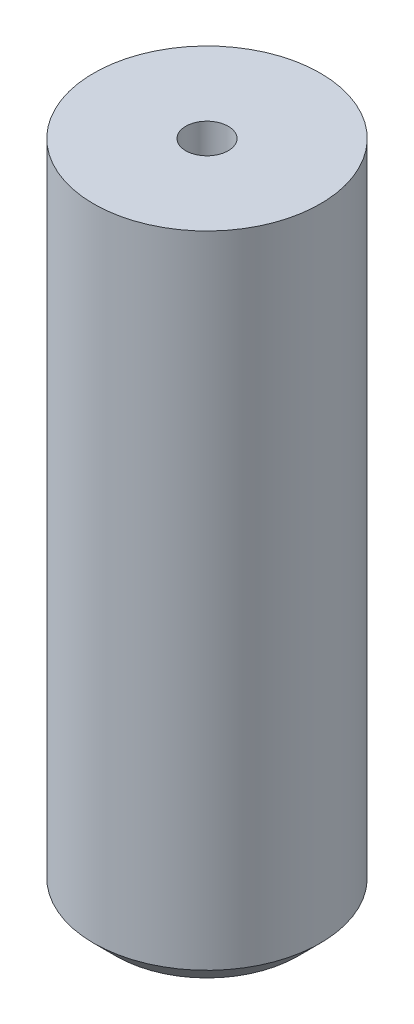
ISO-10303-21;
HEADER;
FILE_DESCRIPTION(('STEP AP214'),'2;1');
FILE_NAME('part.step','',(''),(''),'','','');
FILE_SCHEMA(('AUTOMOTIVE_DESIGN { 1 0 10303 214 1 1 1 1 }'));
ENDSEC;
DATA;
#1=APPLICATION_CONTEXT('core data for automotive mechanical design processes');
#2=APPLICATION_PROTOCOL_DEFINITION('international standard','automotive_design',2000,#1);
#3=PRODUCT_CONTEXT('',#1,'mechanical');
#4=PRODUCT('Part','Part','',(#3));
#5=PRODUCT_RELATED_PRODUCT_CATEGORY('part','',(#4));
#6=PRODUCT_DEFINITION_FORMATION('','',#4);
#7=PRODUCT_DEFINITION_CONTEXT('part definition',#1,'design');
#8=PRODUCT_DEFINITION('design','',#6,#7);
#9=PRODUCT_DEFINITION_SHAPE('','',#8);
#10=(LENGTH_UNIT() NAMED_UNIT(*) SI_UNIT(.MILLI.,.METRE.));
#11=(NAMED_UNIT(*) PLANE_ANGLE_UNIT() SI_UNIT($,.RADIAN.));
#12=(NAMED_UNIT(*) SI_UNIT($,.STERADIAN.) SOLID_ANGLE_UNIT());
#13=UNCERTAINTY_MEASURE_WITH_UNIT(LENGTH_MEASURE(1.E-05),#10,'distance_accuracy_value','');
#14=(GEOMETRIC_REPRESENTATION_CONTEXT(3) GLOBAL_UNCERTAINTY_ASSIGNED_CONTEXT((#13)) GLOBAL_UNIT_ASSIGNED_CONTEXT((#10,
#11,#12)) REPRESENTATION_CONTEXT('',''));
#15=CARTESIAN_POINT('',(0.,0.,0.));
#16=DIRECTION('',(0.,0.,1.));
#17=DIRECTION('',(1.,0.,0.));
#18=AXIS2_PLACEMENT_3D('',#15,#16,#17);
#19=CARTESIAN_POINT('',(0.,0.,0.));
#20=DIRECTION('',(0.,1.,0.));
#21=DIRECTION('',(0.,0.,1.));
#22=AXIS2_PLACEMENT_3D('',#19,#20,#21);
#23=PLANE('',#22);
#24=CARTESIAN_POINT('',(0.,0.,0.));
#25=DIRECTION('',(0.,1.,0.));
#26=DIRECTION('',(0.,0.,1.));
#27=AXIS2_PLACEMENT_3D('',#24,#25,#26);
#28=CIRCLE('',#27,0.374999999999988);
#29=CARTESIAN_POINT('',(0.,0.,0.374999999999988));
#30=VERTEX_POINT('',#29);
#31=EDGE_CURVE('E55',#30,#30,#28,.T.);
#32=ORIENTED_EDGE('',*,*,#31,.F.);
#33=EDGE_LOOP('',(#32));
#34=FACE_BOUND('',#33,.T.);
#35=CARTESIAN_POINT('',(0.,0.,0.));
#36=DIRECTION('',(0.,-1.,0.));
#37=DIRECTION('',(0.,0.,-1.));
#38=AXIS2_PLACEMENT_3D('',#35,#36,#37);
#39=CIRCLE('',#38,2.);
#40=CARTESIAN_POINT('',(0.,0.,-2.));
#41=VERTEX_POINT('',#40);
#42=EDGE_CURVE('E10',#41,#41,#39,.T.);
#43=ORIENTED_EDGE('',*,*,#42,.F.);
#44=EDGE_LOOP('',(#43));
#45=FACE_BOUND('',#44,.T.);
#46=ADVANCED_FACE('F30',(#34,#45),#23,.T.);
#47=CARTESIAN_POINT('',(0.,0.,0.));
#48=DIRECTION('',(0.,-1.,0.));
#49=DIRECTION('',(0.,0.,-1.));
#50=AXIS2_PLACEMENT_3D('',#47,#48,#49);
#51=CYLINDRICAL_SURFACE('',#50,2.);
#52=ORIENTED_EDGE('',*,*,#42,.T.);
#53=EDGE_LOOP('',(#52));
#54=FACE_BOUND('',#53,.T.);
#55=CARTESIAN_POINT('',(0.,-11.3,0.));
#56=DIRECTION('',(0.,-1.,0.));
#57=DIRECTION('',(0.,0.,-1.));
#58=AXIS2_PLACEMENT_3D('',#55,#56,#57);
#59=CIRCLE('',#58,2.);
#60=CARTESIAN_POINT('',(0.,-11.3,-2.));
#61=VERTEX_POINT('',#60);
#62=EDGE_CURVE('E36',#61,#61,#59,.T.);
#63=ORIENTED_EDGE('',*,*,#62,.F.);
#64=EDGE_LOOP('',(#63));
#65=FACE_BOUND('',#64,.T.);
#66=ADVANCED_FACE('F63',(#54,#65),#51,.T.);
#67=CARTESIAN_POINT('',(0.,-11.7,0.));
#68=DIRECTION('',(0.,1.,0.));
#69=DIRECTION('',(0.,0.,1.));
#70=AXIS2_PLACEMENT_3D('',#67,#68,#69);
#71=CONICAL_SURFACE('',#70,1.6,0.785398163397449);
#72=ORIENTED_EDGE('',*,*,#62,.T.);
#73=EDGE_LOOP('',(#72));
#74=FACE_BOUND('',#73,.T.);
#75=CARTESIAN_POINT('',(0.,-11.7,0.));
#76=DIRECTION('',(0.,-1.,0.));
#77=DIRECTION('',(0.,0.,-1.));
#78=AXIS2_PLACEMENT_3D('',#75,#76,#77);
#79=CIRCLE('',#78,1.6);
#80=CARTESIAN_POINT('',(0.,-11.7,-1.6));
#81=VERTEX_POINT('',#80);
#82=EDGE_CURVE('E40',#81,#81,#79,.T.);
#83=ORIENTED_EDGE('',*,*,#82,.F.);
#84=EDGE_LOOP('',(#83));
#85=FACE_BOUND('',#84,.T.);
#86=ADVANCED_FACE('F67',(#74,#85),#71,.T.);
#87=CARTESIAN_POINT('',(1.6,-11.7,0.));
#88=DIRECTION('',(0.,-1.,0.));
#89=DIRECTION('',(0.,0.,-1.));
#90=AXIS2_PLACEMENT_3D('',#87,#88,#89);
#91=PLANE('',#90);
#92=ORIENTED_EDGE('',*,*,#82,.T.);
#93=EDGE_LOOP('',(#92));
#94=FACE_BOUND('',#93,.T.);
#95=CARTESIAN_POINT('',(0.,-11.7,0.));
#96=DIRECTION('',(0.,-1.,0.));
#97=DIRECTION('',(0.,0.,-1.));
#98=AXIS2_PLACEMENT_3D('',#95,#96,#97);
#99=CIRCLE('',#98,1.);
#100=CARTESIAN_POINT('',(0.,-11.7,-1.));
#101=VERTEX_POINT('',#100);
#102=EDGE_CURVE('E44',#101,#101,#99,.T.);
#103=ORIENTED_EDGE('',*,*,#102,.F.);
#104=EDGE_LOOP('',(#103));
#105=FACE_BOUND('',#104,.T.);
#106=ADVANCED_FACE('F71',(#94,#105),#91,.T.);
#107=CARTESIAN_POINT('',(0.,0.,0.));
#108=DIRECTION('',(0.,-1.,0.));
#109=DIRECTION('',(0.,0.,-1.));
#110=AXIS2_PLACEMENT_3D('',#107,#108,#109);
#111=CYLINDRICAL_SURFACE('',#110,1.);
#112=ORIENTED_EDGE('',*,*,#102,.T.);
#113=EDGE_LOOP('',(#112));
#114=FACE_BOUND('',#113,.T.);
#115=CARTESIAN_POINT('',(0.,-8.7,0.));
#116=DIRECTION('',(0.,-1.,0.));
#117=DIRECTION('',(0.,0.,-1.));
#118=AXIS2_PLACEMENT_3D('',#115,#116,#117);
#119=CIRCLE('',#118,1.);
#120=CARTESIAN_POINT('',(0.,-8.7,-1.));
#121=VERTEX_POINT('',#120);
#122=EDGE_CURVE('E49',#121,#121,#119,.T.);
#123=ORIENTED_EDGE('',*,*,#122,.F.);
#124=EDGE_LOOP('',(#123));
#125=FACE_BOUND('',#124,.T.);
#126=ADVANCED_FACE('F77',(#114,#125),#111,.F.);
#127=CARTESIAN_POINT('',(1.,-8.7,0.));
#128=DIRECTION('',(0.,-1.,0.));
#129=DIRECTION('',(0.,0.,-1.));
#130=AXIS2_PLACEMENT_3D('',#127,#128,#129);
#131=PLANE('',#130);
#132=CARTESIAN_POINT('',(0.,-8.7,0.));
#133=DIRECTION('',(0.,-1.,0.));
#134=DIRECTION('',(0.,0.,-1.));
#135=AXIS2_PLACEMENT_3D('',#132,#133,#134);
#136=CIRCLE('',#135,0.374999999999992);
#137=CARTESIAN_POINT('',(0.,-8.7,-0.374999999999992));
#138=VERTEX_POINT('',#137);
#139=EDGE_CURVE('E52',#138,#138,#136,.T.);
#140=ORIENTED_EDGE('',*,*,#139,.F.);
#141=EDGE_LOOP('',(#140));
#142=FACE_BOUND('',#141,.T.);
#143=ORIENTED_EDGE('',*,*,#122,.T.);
#144=EDGE_LOOP('',(#143));
#145=FACE_BOUND('',#144,.T.);
#146=ADVANCED_FACE('F81',(#142,#145),#131,.T.);
#147=CARTESIAN_POINT('',(0.,0.,0.));
#148=DIRECTION('',(0.,1.,0.));
#149=DIRECTION('',(0.,0.,1.));
#150=AXIS2_PLACEMENT_3D('',#147,#148,#149);
#151=CYLINDRICAL_SURFACE('',#150,0.374999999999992);
#152=ORIENTED_EDGE('',*,*,#139,.T.);
#153=EDGE_LOOP('',(#152));
#154=FACE_BOUND('',#153,.T.);
#155=ORIENTED_EDGE('',*,*,#31,.T.);
#156=EDGE_LOOP('',(#155));
#157=FACE_BOUND('',#156,.T.);
#158=ADVANCED_FACE('F59',(#154,#157),#151,.F.);
#159=CLOSED_SHELL('',(#46,#66,#86,#106,#126,#146,#158));
#160=MANIFOLD_SOLID_BREP('B2',#159);
#161=ADVANCED_BREP_SHAPE_REPRESENTATION('',(#18,#160),#14);
#162=SHAPE_DEFINITION_REPRESENTATION(#9,#161);
ENDSEC;
END-ISO-10303-21;
